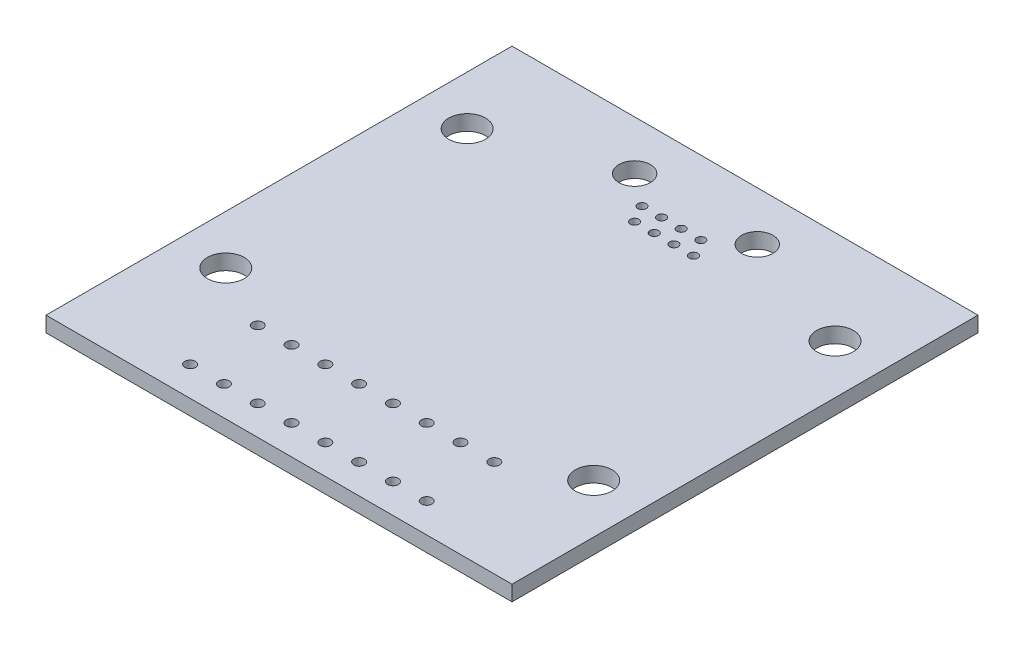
ISO-10303-21;
HEADER;
FILE_DESCRIPTION(('STEP AP214'),'2;1');
FILE_NAME('part.step','',(''),(''),'','','');
FILE_SCHEMA(('AUTOMOTIVE_DESIGN { 1 0 10303 214 1 1 1 1 }'));
ENDSEC;
DATA;
#1=APPLICATION_CONTEXT('core data for automotive mechanical design processes');
#2=APPLICATION_PROTOCOL_DEFINITION('international standard','automotive_design',2000,#1);
#3=PRODUCT_CONTEXT('',#1,'mechanical');
#4=PRODUCT('Part','Part','',(#3));
#5=PRODUCT_RELATED_PRODUCT_CATEGORY('part','',(#4));
#6=PRODUCT_DEFINITION_FORMATION('','',#4);
#7=PRODUCT_DEFINITION_CONTEXT('part definition',#1,'design');
#8=PRODUCT_DEFINITION('design','',#6,#7);
#9=PRODUCT_DEFINITION_SHAPE('','',#8);
#10=(LENGTH_UNIT() NAMED_UNIT(*) SI_UNIT(.MILLI.,.METRE.));
#11=(NAMED_UNIT(*) PLANE_ANGLE_UNIT() SI_UNIT($,.RADIAN.));
#12=(NAMED_UNIT(*) SI_UNIT($,.STERADIAN.) SOLID_ANGLE_UNIT());
#13=UNCERTAINTY_MEASURE_WITH_UNIT(LENGTH_MEASURE(1.E-05),#10,'distance_accuracy_value','');
#14=(GEOMETRIC_REPRESENTATION_CONTEXT(3) GLOBAL_UNCERTAINTY_ASSIGNED_CONTEXT((#13)) GLOBAL_UNIT_ASSIGNED_CONTEXT((#10,
#11,#12)) REPRESENTATION_CONTEXT('',''));
#15=CARTESIAN_POINT('',(0.,0.,0.));
#16=DIRECTION('',(0.,0.,1.));
#17=DIRECTION('',(1.,0.,0.));
#18=AXIS2_PLACEMENT_3D('',#15,#16,#17);
#19=CARTESIAN_POINT('',(0.,1.5875,0.));
#20=DIRECTION('',(0.,1.,0.));
#21=DIRECTION('',(0.,0.,1.));
#22=AXIS2_PLACEMENT_3D('',#19,#20,#21);
#23=PLANE('',#22);
#24=CARTESIAN_POINT('',(8.75,1.5875,-3.048));
#25=DIRECTION('',(0.,1.,0.));
#26=DIRECTION('',(0.,0.,-1.));
#27=AXIS2_PLACEMENT_3D('',#24,#25,#26);
#28=CIRCLE('',#27,0.55);
#29=CARTESIAN_POINT('',(8.75,1.5875,-3.598));
#30=VERTEX_POINT('',#29);
#31=EDGE_CURVE('E277',#30,#30,#28,.T.);
#32=ORIENTED_EDGE('',*,*,#31,.F.);
#33=EDGE_LOOP('',(#32));
#34=FACE_BOUND('',#33,.T.);
#35=CARTESIAN_POINT('',(1.75,1.5875,-3.048));
#36=DIRECTION('',(0.,1.,0.));
#37=DIRECTION('',(0.,0.,-1.));
#38=AXIS2_PLACEMENT_3D('',#35,#36,#37);
#39=CIRCLE('',#38,0.55);
#40=CARTESIAN_POINT('',(1.75,1.5875,-3.598));
#41=VERTEX_POINT('',#40);
#42=EDGE_CURVE('E265',#41,#41,#39,.T.);
#43=ORIENTED_EDGE('',*,*,#42,.F.);
#44=EDGE_LOOP('',(#43));
#45=FACE_BOUND('',#44,.T.);
#46=CARTESIAN_POINT('',(5.25,1.5875,-10.04824));
#47=DIRECTION('',(0.,1.,0.));
#48=DIRECTION('',(0.,0.,-1.));
#49=AXIS2_PLACEMENT_3D('',#46,#47,#48);
#50=CIRCLE('',#49,0.550000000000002);
#51=CARTESIAN_POINT('',(5.25,1.5875,-10.59824));
#52=VERTEX_POINT('',#51);
#53=EDGE_CURVE('E253',#52,#52,#50,.T.);
#54=ORIENTED_EDGE('',*,*,#53,.F.);
#55=EDGE_LOOP('',(#54));
#56=FACE_BOUND('',#55,.T.);
#57=CARTESIAN_POINT('',(12.25,1.5875,-10.04824));
#58=DIRECTION('',(0.,1.,0.));
#59=DIRECTION('',(0.,0.,-1.));
#60=AXIS2_PLACEMENT_3D('',#57,#58,#59);
#61=CIRCLE('',#60,0.549999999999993);
#62=CARTESIAN_POINT('',(12.25,1.5875,-10.59824));
#63=VERTEX_POINT('',#62);
#64=EDGE_CURVE('E241',#63,#63,#61,.T.);
#65=ORIENTED_EDGE('',*,*,#64,.F.);
#66=EDGE_LOOP('',(#65));
#67=FACE_BOUND('',#66,.T.);
#68=CARTESIAN_POINT('',(19.05,1.5875,-38.53434));
#69=DIRECTION('',(0.,1.,0.));
#70=DIRECTION('',(0.,0.,-1.));
#71=AXIS2_PLACEMENT_3D('',#68,#69,#70);
#72=CIRCLE('',#71,1.905);
#73=CARTESIAN_POINT('',(19.05,1.5875,-40.43934));
#74=VERTEX_POINT('',#73);
#75=EDGE_CURVE('E229',#74,#74,#72,.T.);
#76=ORIENTED_EDGE('',*,*,#75,.F.);
#77=EDGE_LOOP('',(#76));
#78=FACE_BOUND('',#77,.T.);
#79=CARTESIAN_POINT('',(4.064,1.5875,-38.862));
#80=DIRECTION('',(0.,1.,0.));
#81=DIRECTION('',(0.,0.,1.));
#82=AXIS2_PLACEMENT_3D('',#79,#80,#81);
#83=CIRCLE('',#82,0.4445);
#84=CARTESIAN_POINT('',(4.064,1.5875,-38.4175));
#85=VERTEX_POINT('',#84);
#86=EDGE_CURVE('E217',#85,#85,#83,.T.);
#87=ORIENTED_EDGE('',*,*,#86,.F.);
#88=EDGE_LOOP('',(#87));
#89=FACE_BOUND('',#88,.T.);
#90=CARTESIAN_POINT('',(0.,1.5875,-38.862));
#91=DIRECTION('',(0.,1.,0.));
#92=DIRECTION('',(0.,0.,1.));
#93=AXIS2_PLACEMENT_3D('',#90,#91,#92);
#94=CIRCLE('',#93,0.444499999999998);
#95=CARTESIAN_POINT('',(0.,1.5875,-38.4175));
#96=VERTEX_POINT('',#95);
#97=EDGE_CURVE('E205',#96,#96,#94,.T.);
#98=ORIENTED_EDGE('',*,*,#97,.F.);
#99=EDGE_LOOP('',(#98));
#100=FACE_BOUND('',#99,.T.);
#101=CARTESIAN_POINT('',(3.048,1.5875,-40.64));
#102=DIRECTION('',(0.,1.,0.));
#103=DIRECTION('',(0.,0.,1.));
#104=AXIS2_PLACEMENT_3D('',#101,#102,#103);
#105=CIRCLE('',#104,0.444499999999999);
#106=CARTESIAN_POINT('',(3.048,1.5875,-40.1955));
#107=VERTEX_POINT('',#106);
#108=EDGE_CURVE('E193',#107,#107,#105,.T.);
#109=ORIENTED_EDGE('',*,*,#108,.F.);
#110=EDGE_LOOP('',(#109));
#111=FACE_BOUND('',#110,.T.);
#112=CARTESIAN_POINT('',(-1.016,1.5875,-40.64));
#113=DIRECTION('',(0.,1.,0.));
#114=DIRECTION('',(0.,0.,1.));
#115=AXIS2_PLACEMENT_3D('',#112,#113,#114);
#116=CIRCLE('',#115,0.444499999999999);
#117=CARTESIAN_POINT('',(-1.016,1.5875,-40.1955));
#118=VERTEX_POINT('',#117);
#119=EDGE_CURVE('E181',#118,#118,#116,.T.);
#120=ORIENTED_EDGE('',*,*,#119,.F.);
#121=EDGE_LOOP('',(#120));
#122=FACE_BOUND('',#121,.T.);
#123=CARTESIAN_POINT('',(-1.75,1.5875,-3.048));
#124=DIRECTION('',(0.,1.,0.));
#125=DIRECTION('',(0.,0.,1.));
#126=AXIS2_PLACEMENT_3D('',#123,#124,#125);
#127=CIRCLE('',#126,0.55);
#128=CARTESIAN_POINT('',(-1.75,1.5875,-2.498));
#129=VERTEX_POINT('',#128);
#130=EDGE_CURVE('E169',#129,#129,#127,.T.);
#131=ORIENTED_EDGE('',*,*,#130,.F.);
#132=EDGE_LOOP('',(#131));
#133=FACE_BOUND('',#132,.T.);
#134=CARTESIAN_POINT('',(-5.25,1.5875,-10.04824));
#135=DIRECTION('',(0.,1.,0.));
#136=DIRECTION('',(0.,0.,1.));
#137=AXIS2_PLACEMENT_3D('',#134,#135,#136);
#138=CIRCLE('',#137,0.55);
#139=CARTESIAN_POINT('',(-5.25,1.5875,-9.49824));
#140=VERTEX_POINT('',#139);
#141=EDGE_CURVE('E157',#140,#140,#138,.T.);
#142=ORIENTED_EDGE('',*,*,#141,.F.);
#143=EDGE_LOOP('',(#142));
#144=FACE_BOUND('',#143,.T.);
#145=CARTESIAN_POINT('',(-8.75,1.5875,-10.04824));
#146=DIRECTION('',(0.,1.,0.));
#147=DIRECTION('',(0.,0.,1.));
#148=AXIS2_PLACEMENT_3D('',#145,#146,#147);
#149=CIRCLE('',#148,0.55);
#150=CARTESIAN_POINT('',(-8.75,1.5875,-9.49824));
#151=VERTEX_POINT('',#150);
#152=EDGE_CURVE('E145',#151,#151,#149,.T.);
#153=ORIENTED_EDGE('',*,*,#152,.F.);
#154=EDGE_LOOP('',(#153));
#155=FACE_BOUND('',#154,.T.);
#156=CARTESIAN_POINT('',(-12.25,1.5875,-3.048));
#157=DIRECTION('',(0.,1.,0.));
#158=DIRECTION('',(0.,0.,1.));
#159=AXIS2_PLACEMENT_3D('',#156,#157,#158);
#160=CIRCLE('',#159,0.549999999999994);
#161=CARTESIAN_POINT('',(-12.25,1.5875,-2.49800000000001));
#162=VERTEX_POINT('',#161);
#163=EDGE_CURVE('E133',#162,#162,#160,.T.);
#164=ORIENTED_EDGE('',*,*,#163,.F.);
#165=EDGE_LOOP('',(#164));
#166=FACE_BOUND('',#165,.T.);
#167=CARTESIAN_POINT('',(-19.05,1.5875,-13.5382));
#168=DIRECTION('',(0.,1.,0.));
#169=DIRECTION('',(0.,0.,1.));
#170=AXIS2_PLACEMENT_3D('',#167,#168,#169);
#171=CIRCLE('',#170,1.905);
#172=CARTESIAN_POINT('',(-19.05,1.5875,-11.6332));
#173=VERTEX_POINT('',#172);
#174=EDGE_CURVE('E121',#173,#173,#171,.T.);
#175=ORIENTED_EDGE('',*,*,#174,.F.);
#176=EDGE_LOOP('',(#175));
#177=FACE_BOUND('',#176,.T.);
#178=CARTESIAN_POINT('',(-6.35,1.5875,-43.18));
#179=DIRECTION('',(0.,1.,0.));
#180=DIRECTION('',(0.,0.,1.));
#181=AXIS2_PLACEMENT_3D('',#178,#179,#180);
#182=CIRCLE('',#181,1.6256);
#183=CARTESIAN_POINT('',(-6.35,1.5875,-41.5544));
#184=VERTEX_POINT('',#183);
#185=EDGE_CURVE('E100',#184,#184,#182,.T.);
#186=ORIENTED_EDGE('',*,*,#185,.F.);
#187=EDGE_LOOP('',(#186));
#188=FACE_BOUND('',#187,.T.);
#189=DIRECTION('',(0.,0.,1.));
#190=VECTOR('',#189,1.);
#191=CARTESIAN_POINT('',(-24.13,1.5875,-48.26));
#192=LINE('',#191,#190);
#193=CARTESIAN_POINT('',(-24.13,1.5875,-48.26));
#194=VERTEX_POINT('',#193);
#195=CARTESIAN_POINT('',(-24.13,1.5875,0.));
#196=VERTEX_POINT('',#195);
#197=EDGE_CURVE('E85',#194,#196,#192,.T.);
#198=ORIENTED_EDGE('',*,*,#197,.T.);
#199=DIRECTION('',(1.,0.,0.));
#200=VECTOR('',#199,1.);
#201=CARTESIAN_POINT('',(-24.13,1.5875,0.));
#202=LINE('',#201,#200);
#203=CARTESIAN_POINT('',(24.13,1.5875,0.));
#204=VERTEX_POINT('',#203);
#205=EDGE_CURVE('E80',#196,#204,#202,.T.);
#206=ORIENTED_EDGE('',*,*,#205,.T.);
#207=DIRECTION('',(0.,0.,-1.));
#208=VECTOR('',#207,1.);
#209=CARTESIAN_POINT('',(24.13,1.5875,-48.26));
#210=LINE('',#209,#208);
#211=CARTESIAN_POINT('',(24.13,1.5875,-48.26));
#212=VERTEX_POINT('',#211);
#213=EDGE_CURVE('E83',#204,#212,#210,.T.);
#214=ORIENTED_EDGE('',*,*,#213,.T.);
#215=DIRECTION('',(-1.,0.,0.));
#216=VECTOR('',#215,1.);
#217=CARTESIAN_POINT('',(-24.13,1.5875,-48.26));
#218=LINE('',#217,#216);
#219=EDGE_CURVE('E50',#212,#194,#218,.T.);
#220=ORIENTED_EDGE('',*,*,#219,.T.);
#221=EDGE_LOOP('',(#198,#206,#214,#220));
#222=FACE_BOUND('',#221,.T.);
#223=CARTESIAN_POINT('',(-19.05,1.5875,-38.53434));
#224=DIRECTION('',(0.,1.,0.));
#225=DIRECTION('',(0.,0.,1.));
#226=AXIS2_PLACEMENT_3D('',#223,#224,#225);
#227=CIRCLE('',#226,1.905);
#228=CARTESIAN_POINT('',(-19.05,1.5875,-36.62934));
#229=VERTEX_POINT('',#228);
#230=EDGE_CURVE('E115',#229,#229,#227,.T.);
#231=ORIENTED_EDGE('',*,*,#230,.F.);
#232=EDGE_LOOP('',(#231));
#233=FACE_BOUND('',#232,.T.);
#234=CARTESIAN_POINT('',(-12.25,1.5875,-10.04824));
#235=DIRECTION('',(0.,1.,0.));
#236=DIRECTION('',(0.,0.,1.));
#237=AXIS2_PLACEMENT_3D('',#234,#235,#236);
#238=CIRCLE('',#237,0.549999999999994);
#239=CARTESIAN_POINT('',(-12.25,1.5875,-9.49824));
#240=VERTEX_POINT('',#239);
#241=EDGE_CURVE('E127',#240,#240,#238,.T.);
#242=ORIENTED_EDGE('',*,*,#241,.F.);
#243=EDGE_LOOP('',(#242));
#244=FACE_BOUND('',#243,.T.);
#245=CARTESIAN_POINT('',(-8.75,1.5875,-3.048));
#246=DIRECTION('',(0.,1.,0.));
#247=DIRECTION('',(0.,0.,1.));
#248=AXIS2_PLACEMENT_3D('',#245,#246,#247);
#249=CIRCLE('',#248,0.55);
#250=CARTESIAN_POINT('',(-8.75,1.5875,-2.498));
#251=VERTEX_POINT('',#250);
#252=EDGE_CURVE('E139',#251,#251,#249,.T.);
#253=ORIENTED_EDGE('',*,*,#252,.F.);
#254=EDGE_LOOP('',(#253));
#255=FACE_BOUND('',#254,.T.);
#256=CARTESIAN_POINT('',(-5.25,1.5875,-3.048));
#257=DIRECTION('',(0.,1.,0.));
#258=DIRECTION('',(0.,0.,1.));
#259=AXIS2_PLACEMENT_3D('',#256,#257,#258);
#260=CIRCLE('',#259,0.55);
#261=CARTESIAN_POINT('',(-5.25,1.5875,-2.498));
#262=VERTEX_POINT('',#261);
#263=EDGE_CURVE('E151',#262,#262,#260,.T.);
#264=ORIENTED_EDGE('',*,*,#263,.F.);
#265=EDGE_LOOP('',(#264));
#266=FACE_BOUND('',#265,.T.);
#267=CARTESIAN_POINT('',(-1.75,1.5875,-10.04824));
#268=DIRECTION('',(0.,1.,0.));
#269=DIRECTION('',(0.,0.,1.));
#270=AXIS2_PLACEMENT_3D('',#267,#268,#269);
#271=CIRCLE('',#270,0.55);
#272=CARTESIAN_POINT('',(-1.75,1.5875,-9.49824));
#273=VERTEX_POINT('',#272);
#274=EDGE_CURVE('E163',#273,#273,#271,.T.);
#275=ORIENTED_EDGE('',*,*,#274,.F.);
#276=EDGE_LOOP('',(#275));
#277=FACE_BOUND('',#276,.T.);
#278=CARTESIAN_POINT('',(-3.048,1.5875,-40.64));
#279=DIRECTION('',(0.,1.,0.));
#280=DIRECTION('',(0.,0.,1.));
#281=AXIS2_PLACEMENT_3D('',#278,#279,#280);
#282=CIRCLE('',#281,0.444499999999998);
#283=CARTESIAN_POINT('',(-3.048,1.5875,-40.1955));
#284=VERTEX_POINT('',#283);
#285=EDGE_CURVE('E175',#284,#284,#282,.T.);
#286=ORIENTED_EDGE('',*,*,#285,.F.);
#287=EDGE_LOOP('',(#286));
#288=FACE_BOUND('',#287,.T.);
#289=CARTESIAN_POINT('',(1.016,1.5875,-40.64));
#290=DIRECTION('',(0.,1.,0.));
#291=DIRECTION('',(0.,0.,1.));
#292=AXIS2_PLACEMENT_3D('',#289,#290,#291);
#293=CIRCLE('',#292,0.444499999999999);
#294=CARTESIAN_POINT('',(1.016,1.5875,-40.1955));
#295=VERTEX_POINT('',#294);
#296=EDGE_CURVE('E187',#295,#295,#293,.T.);
#297=ORIENTED_EDGE('',*,*,#296,.F.);
#298=EDGE_LOOP('',(#297));
#299=FACE_BOUND('',#298,.T.);
#300=CARTESIAN_POINT('',(-2.032,1.5875,-38.862));
#301=DIRECTION('',(0.,1.,0.));
#302=DIRECTION('',(0.,0.,1.));
#303=AXIS2_PLACEMENT_3D('',#300,#301,#302);
#304=CIRCLE('',#303,0.444499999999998);
#305=CARTESIAN_POINT('',(-2.032,1.5875,-38.4175));
#306=VERTEX_POINT('',#305);
#307=EDGE_CURVE('E199',#306,#306,#304,.T.);
#308=ORIENTED_EDGE('',*,*,#307,.F.);
#309=EDGE_LOOP('',(#308));
#310=FACE_BOUND('',#309,.T.);
#311=CARTESIAN_POINT('',(2.032,1.5875,-38.862));
#312=DIRECTION('',(0.,1.,0.));
#313=DIRECTION('',(0.,0.,1.));
#314=AXIS2_PLACEMENT_3D('',#311,#312,#313);
#315=CIRCLE('',#314,0.444499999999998);
#316=CARTESIAN_POINT('',(2.032,1.5875,-38.4175));
#317=VERTEX_POINT('',#316);
#318=EDGE_CURVE('E211',#317,#317,#315,.T.);
#319=ORIENTED_EDGE('',*,*,#318,.F.);
#320=EDGE_LOOP('',(#319));
#321=FACE_BOUND('',#320,.T.);
#322=CARTESIAN_POINT('',(6.34999999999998,1.5875,-43.18));
#323=DIRECTION('',(0.,1.,0.));
#324=DIRECTION('',(0.,0.,-1.));
#325=AXIS2_PLACEMENT_3D('',#322,#323,#324);
#326=CIRCLE('',#325,1.6256);
#327=CARTESIAN_POINT('',(6.34999999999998,1.5875,-44.8056));
#328=VERTEX_POINT('',#327);
#329=EDGE_CURVE('E223',#328,#328,#326,.T.);
#330=ORIENTED_EDGE('',*,*,#329,.F.);
#331=EDGE_LOOP('',(#330));
#332=FACE_BOUND('',#331,.T.);
#333=CARTESIAN_POINT('',(19.05,1.5875,-13.5382));
#334=DIRECTION('',(0.,1.,0.));
#335=DIRECTION('',(0.,0.,-1.));
#336=AXIS2_PLACEMENT_3D('',#333,#334,#335);
#337=CIRCLE('',#336,1.905);
#338=CARTESIAN_POINT('',(19.05,1.5875,-15.4432));
#339=VERTEX_POINT('',#338);
#340=EDGE_CURVE('E235',#339,#339,#337,.T.);
#341=ORIENTED_EDGE('',*,*,#340,.F.);
#342=EDGE_LOOP('',(#341));
#343=FACE_BOUND('',#342,.T.);
#344=CARTESIAN_POINT('',(8.75,1.5875,-10.04824));
#345=DIRECTION('',(0.,1.,0.));
#346=DIRECTION('',(0.,0.,-1.));
#347=AXIS2_PLACEMENT_3D('',#344,#345,#346);
#348=CIRCLE('',#347,0.55);
#349=CARTESIAN_POINT('',(8.75,1.5875,-10.59824));
#350=VERTEX_POINT('',#349);
#351=EDGE_CURVE('E247',#350,#350,#348,.T.);
#352=ORIENTED_EDGE('',*,*,#351,.F.);
#353=EDGE_LOOP('',(#352));
#354=FACE_BOUND('',#353,.T.);
#355=CARTESIAN_POINT('',(1.75,1.5875,-10.04824));
#356=DIRECTION('',(0.,1.,0.));
#357=DIRECTION('',(0.,0.,-1.));
#358=AXIS2_PLACEMENT_3D('',#355,#356,#357);
#359=CIRCLE('',#358,0.55);
#360=CARTESIAN_POINT('',(1.75,1.5875,-10.59824));
#361=VERTEX_POINT('',#360);
#362=EDGE_CURVE('E259',#361,#361,#359,.T.);
#363=ORIENTED_EDGE('',*,*,#362,.F.);
#364=EDGE_LOOP('',(#363));
#365=FACE_BOUND('',#364,.T.);
#366=CARTESIAN_POINT('',(5.25,1.5875,-3.048));
#367=DIRECTION('',(0.,1.,0.));
#368=DIRECTION('',(0.,0.,-1.));
#369=AXIS2_PLACEMENT_3D('',#366,#367,#368);
#370=CIRCLE('',#369,0.55);
#371=CARTESIAN_POINT('',(5.25,1.5875,-3.598));
#372=VERTEX_POINT('',#371);
#373=EDGE_CURVE('E271',#372,#372,#370,.T.);
#374=ORIENTED_EDGE('',*,*,#373,.F.);
#375=EDGE_LOOP('',(#374));
#376=FACE_BOUND('',#375,.T.);
#377=CARTESIAN_POINT('',(12.25,1.5875,-3.048));
#378=DIRECTION('',(0.,1.,0.));
#379=DIRECTION('',(0.,0.,-1.));
#380=AXIS2_PLACEMENT_3D('',#377,#378,#379);
#381=CIRCLE('',#380,0.549999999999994);
#382=CARTESIAN_POINT('',(12.25,1.5875,-3.598));
#383=VERTEX_POINT('',#382);
#384=EDGE_CURVE('E283',#383,#383,#381,.T.);
#385=ORIENTED_EDGE('',*,*,#384,.F.);
#386=EDGE_LOOP('',(#385));
#387=FACE_BOUND('',#386,.T.);
#388=ADVANCED_FACE('F33',(#34,#45,#56,#67,#78,#89,#100,#111,#122,#133,#144,#155,#166,#177,#188,
#222,#233,#244,#255,#266,#277,#288,#299,#310,#321,#332,#343,#354,#365,#376,#387),#23,.T.);
#389=CARTESIAN_POINT('',(0.,0.,0.));
#390=DIRECTION('',(0.,1.,0.));
#391=DIRECTION('',(0.,0.,1.));
#392=AXIS2_PLACEMENT_3D('',#389,#390,#391);
#393=PLANE('',#392);
#394=CARTESIAN_POINT('',(8.75,0.,-3.048));
#395=DIRECTION('',(0.,1.,0.));
#396=DIRECTION('',(0.,0.,-1.));
#397=AXIS2_PLACEMENT_3D('',#394,#395,#396);
#398=CIRCLE('',#397,0.55);
#399=CARTESIAN_POINT('',(8.75,0.,-3.598));
#400=VERTEX_POINT('',#399);
#401=EDGE_CURVE('E280',#400,#400,#398,.T.);
#402=ORIENTED_EDGE('',*,*,#401,.T.);
#403=EDGE_LOOP('',(#402));
#404=FACE_BOUND('',#403,.T.);
#405=CARTESIAN_POINT('',(1.75,0.,-3.048));
#406=DIRECTION('',(0.,1.,0.));
#407=DIRECTION('',(0.,0.,-1.));
#408=AXIS2_PLACEMENT_3D('',#405,#406,#407);
#409=CIRCLE('',#408,0.55);
#410=CARTESIAN_POINT('',(1.75,0.,-3.598));
#411=VERTEX_POINT('',#410);
#412=EDGE_CURVE('E268',#411,#411,#409,.T.);
#413=ORIENTED_EDGE('',*,*,#412,.T.);
#414=EDGE_LOOP('',(#413));
#415=FACE_BOUND('',#414,.T.);
#416=CARTESIAN_POINT('',(5.25,0.,-10.04824));
#417=DIRECTION('',(0.,1.,0.));
#418=DIRECTION('',(0.,0.,-1.));
#419=AXIS2_PLACEMENT_3D('',#416,#417,#418);
#420=CIRCLE('',#419,0.550000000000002);
#421=CARTESIAN_POINT('',(5.25,0.,-10.59824));
#422=VERTEX_POINT('',#421);
#423=EDGE_CURVE('E256',#422,#422,#420,.T.);
#424=ORIENTED_EDGE('',*,*,#423,.T.);
#425=EDGE_LOOP('',(#424));
#426=FACE_BOUND('',#425,.T.);
#427=CARTESIAN_POINT('',(12.25,0.,-10.04824));
#428=DIRECTION('',(0.,1.,0.));
#429=DIRECTION('',(0.,0.,-1.));
#430=AXIS2_PLACEMENT_3D('',#427,#428,#429);
#431=CIRCLE('',#430,0.549999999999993);
#432=CARTESIAN_POINT('',(12.25,0.,-10.59824));
#433=VERTEX_POINT('',#432);
#434=EDGE_CURVE('E244',#433,#433,#431,.T.);
#435=ORIENTED_EDGE('',*,*,#434,.T.);
#436=EDGE_LOOP('',(#435));
#437=FACE_BOUND('',#436,.T.);
#438=CARTESIAN_POINT('',(19.05,0.,-38.53434));
#439=DIRECTION('',(0.,1.,0.));
#440=DIRECTION('',(0.,0.,-1.));
#441=AXIS2_PLACEMENT_3D('',#438,#439,#440);
#442=CIRCLE('',#441,1.905);
#443=CARTESIAN_POINT('',(19.05,0.,-40.43934));
#444=VERTEX_POINT('',#443);
#445=EDGE_CURVE('E232',#444,#444,#442,.T.);
#446=ORIENTED_EDGE('',*,*,#445,.T.);
#447=EDGE_LOOP('',(#446));
#448=FACE_BOUND('',#447,.T.);
#449=CARTESIAN_POINT('',(4.064,0.,-38.862));
#450=DIRECTION('',(0.,1.,0.));
#451=DIRECTION('',(0.,0.,1.));
#452=AXIS2_PLACEMENT_3D('',#449,#450,#451);
#453=CIRCLE('',#452,0.4445);
#454=CARTESIAN_POINT('',(4.064,0.,-38.4175));
#455=VERTEX_POINT('',#454);
#456=EDGE_CURVE('E220',#455,#455,#453,.T.);
#457=ORIENTED_EDGE('',*,*,#456,.T.);
#458=EDGE_LOOP('',(#457));
#459=FACE_BOUND('',#458,.T.);
#460=CARTESIAN_POINT('',(0.,0.,-38.862));
#461=DIRECTION('',(0.,1.,0.));
#462=DIRECTION('',(0.,0.,1.));
#463=AXIS2_PLACEMENT_3D('',#460,#461,#462);
#464=CIRCLE('',#463,0.444499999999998);
#465=CARTESIAN_POINT('',(0.,0.,-38.4175));
#466=VERTEX_POINT('',#465);
#467=EDGE_CURVE('E208',#466,#466,#464,.T.);
#468=ORIENTED_EDGE('',*,*,#467,.T.);
#469=EDGE_LOOP('',(#468));
#470=FACE_BOUND('',#469,.T.);
#471=CARTESIAN_POINT('',(3.048,0.,-40.64));
#472=DIRECTION('',(0.,1.,0.));
#473=DIRECTION('',(0.,0.,1.));
#474=AXIS2_PLACEMENT_3D('',#471,#472,#473);
#475=CIRCLE('',#474,0.444499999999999);
#476=CARTESIAN_POINT('',(3.048,0.,-40.1955));
#477=VERTEX_POINT('',#476);
#478=EDGE_CURVE('E196',#477,#477,#475,.T.);
#479=ORIENTED_EDGE('',*,*,#478,.T.);
#480=EDGE_LOOP('',(#479));
#481=FACE_BOUND('',#480,.T.);
#482=CARTESIAN_POINT('',(-1.016,0.,-40.64));
#483=DIRECTION('',(0.,1.,0.));
#484=DIRECTION('',(0.,0.,1.));
#485=AXIS2_PLACEMENT_3D('',#482,#483,#484);
#486=CIRCLE('',#485,0.444499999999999);
#487=CARTESIAN_POINT('',(-1.016,0.,-40.1955));
#488=VERTEX_POINT('',#487);
#489=EDGE_CURVE('E184',#488,#488,#486,.T.);
#490=ORIENTED_EDGE('',*,*,#489,.T.);
#491=EDGE_LOOP('',(#490));
#492=FACE_BOUND('',#491,.T.);
#493=CARTESIAN_POINT('',(-1.75,0.,-3.048));
#494=DIRECTION('',(0.,1.,0.));
#495=DIRECTION('',(0.,0.,1.));
#496=AXIS2_PLACEMENT_3D('',#493,#494,#495);
#497=CIRCLE('',#496,0.55);
#498=CARTESIAN_POINT('',(-1.75,0.,-2.498));
#499=VERTEX_POINT('',#498);
#500=EDGE_CURVE('E172',#499,#499,#497,.T.);
#501=ORIENTED_EDGE('',*,*,#500,.T.);
#502=EDGE_LOOP('',(#501));
#503=FACE_BOUND('',#502,.T.);
#504=CARTESIAN_POINT('',(-5.25,0.,-10.04824));
#505=DIRECTION('',(0.,1.,0.));
#506=DIRECTION('',(0.,0.,1.));
#507=AXIS2_PLACEMENT_3D('',#504,#505,#506);
#508=CIRCLE('',#507,0.55);
#509=CARTESIAN_POINT('',(-5.25,0.,-9.49824));
#510=VERTEX_POINT('',#509);
#511=EDGE_CURVE('E160',#510,#510,#508,.T.);
#512=ORIENTED_EDGE('',*,*,#511,.T.);
#513=EDGE_LOOP('',(#512));
#514=FACE_BOUND('',#513,.T.);
#515=CARTESIAN_POINT('',(-8.75,0.,-10.04824));
#516=DIRECTION('',(0.,1.,0.));
#517=DIRECTION('',(0.,0.,1.));
#518=AXIS2_PLACEMENT_3D('',#515,#516,#517);
#519=CIRCLE('',#518,0.55);
#520=CARTESIAN_POINT('',(-8.75,0.,-9.49824));
#521=VERTEX_POINT('',#520);
#522=EDGE_CURVE('E148',#521,#521,#519,.T.);
#523=ORIENTED_EDGE('',*,*,#522,.T.);
#524=EDGE_LOOP('',(#523));
#525=FACE_BOUND('',#524,.T.);
#526=CARTESIAN_POINT('',(-12.25,0.,-3.048));
#527=DIRECTION('',(0.,1.,0.));
#528=DIRECTION('',(0.,0.,1.));
#529=AXIS2_PLACEMENT_3D('',#526,#527,#528);
#530=CIRCLE('',#529,0.549999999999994);
#531=CARTESIAN_POINT('',(-12.25,0.,-2.49800000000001));
#532=VERTEX_POINT('',#531);
#533=EDGE_CURVE('E136',#532,#532,#530,.T.);
#534=ORIENTED_EDGE('',*,*,#533,.T.);
#535=EDGE_LOOP('',(#534));
#536=FACE_BOUND('',#535,.T.);
#537=CARTESIAN_POINT('',(-19.05,0.,-13.5382));
#538=DIRECTION('',(0.,1.,0.));
#539=DIRECTION('',(0.,0.,1.));
#540=AXIS2_PLACEMENT_3D('',#537,#538,#539);
#541=CIRCLE('',#540,1.905);
#542=CARTESIAN_POINT('',(-19.05,0.,-11.6332));
#543=VERTEX_POINT('',#542);
#544=EDGE_CURVE('E124',#543,#543,#541,.T.);
#545=ORIENTED_EDGE('',*,*,#544,.T.);
#546=EDGE_LOOP('',(#545));
#547=FACE_BOUND('',#546,.T.);
#548=CARTESIAN_POINT('',(-6.35,0.,-43.18));
#549=DIRECTION('',(0.,1.,0.));
#550=DIRECTION('',(0.,0.,1.));
#551=AXIS2_PLACEMENT_3D('',#548,#549,#550);
#552=CIRCLE('',#551,1.6256);
#553=CARTESIAN_POINT('',(-6.35,0.,-41.5544));
#554=VERTEX_POINT('',#553);
#555=EDGE_CURVE('E112',#554,#554,#552,.T.);
#556=ORIENTED_EDGE('',*,*,#555,.T.);
#557=EDGE_LOOP('',(#556));
#558=FACE_BOUND('',#557,.T.);
#559=DIRECTION('',(0.,0.,1.));
#560=VECTOR('',#559,1.);
#561=CARTESIAN_POINT('',(-24.13,0.,-48.26));
#562=LINE('',#561,#560);
#563=CARTESIAN_POINT('',(-24.13,0.,-48.26));
#564=VERTEX_POINT('',#563);
#565=CARTESIAN_POINT('',(-24.13,0.,0.));
#566=VERTEX_POINT('',#565);
#567=EDGE_CURVE('E97',#564,#566,#562,.T.);
#568=ORIENTED_EDGE('',*,*,#567,.F.);
#569=DIRECTION('',(-1.,0.,0.));
#570=VECTOR('',#569,1.);
#571=CARTESIAN_POINT('',(-24.13,0.,-48.26));
#572=LINE('',#571,#570);
#573=CARTESIAN_POINT('',(24.13,0.,-48.26));
#574=VERTEX_POINT('',#573);
#575=EDGE_CURVE('E73',#574,#564,#572,.T.);
#576=ORIENTED_EDGE('',*,*,#575,.F.);
#577=DIRECTION('',(0.,0.,-1.));
#578=VECTOR('',#577,1.);
#579=CARTESIAN_POINT('',(24.13,0.,-48.26));
#580=LINE('',#579,#578);
#581=CARTESIAN_POINT('',(24.13,0.,0.));
#582=VERTEX_POINT('',#581);
#583=EDGE_CURVE('E67',#582,#574,#580,.T.);
#584=ORIENTED_EDGE('',*,*,#583,.F.);
#585=DIRECTION('',(1.,0.,0.));
#586=VECTOR('',#585,1.);
#587=CARTESIAN_POINT('',(-24.13,0.,0.));
#588=LINE('',#587,#586);
#589=EDGE_CURVE('E89',#566,#582,#588,.T.);
#590=ORIENTED_EDGE('',*,*,#589,.F.);
#591=EDGE_LOOP('',(#568,#576,#584,#590));
#592=FACE_BOUND('',#591,.T.);
#593=CARTESIAN_POINT('',(-19.05,0.,-38.53434));
#594=DIRECTION('',(0.,1.,0.));
#595=DIRECTION('',(0.,0.,1.));
#596=AXIS2_PLACEMENT_3D('',#593,#594,#595);
#597=CIRCLE('',#596,1.905);
#598=CARTESIAN_POINT('',(-19.05,0.,-36.62934));
#599=VERTEX_POINT('',#598);
#600=EDGE_CURVE('E118',#599,#599,#597,.T.);
#601=ORIENTED_EDGE('',*,*,#600,.T.);
#602=EDGE_LOOP('',(#601));
#603=FACE_BOUND('',#602,.T.);
#604=CARTESIAN_POINT('',(-12.25,0.,-10.04824));
#605=DIRECTION('',(0.,1.,0.));
#606=DIRECTION('',(0.,0.,1.));
#607=AXIS2_PLACEMENT_3D('',#604,#605,#606);
#608=CIRCLE('',#607,0.549999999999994);
#609=CARTESIAN_POINT('',(-12.25,0.,-9.49824));
#610=VERTEX_POINT('',#609);
#611=EDGE_CURVE('E130',#610,#610,#608,.T.);
#612=ORIENTED_EDGE('',*,*,#611,.T.);
#613=EDGE_LOOP('',(#612));
#614=FACE_BOUND('',#613,.T.);
#615=CARTESIAN_POINT('',(-8.75,0.,-3.048));
#616=DIRECTION('',(0.,1.,0.));
#617=DIRECTION('',(0.,0.,1.));
#618=AXIS2_PLACEMENT_3D('',#615,#616,#617);
#619=CIRCLE('',#618,0.55);
#620=CARTESIAN_POINT('',(-8.75,0.,-2.498));
#621=VERTEX_POINT('',#620);
#622=EDGE_CURVE('E142',#621,#621,#619,.T.);
#623=ORIENTED_EDGE('',*,*,#622,.T.);
#624=EDGE_LOOP('',(#623));
#625=FACE_BOUND('',#624,.T.);
#626=CARTESIAN_POINT('',(-5.25,0.,-3.048));
#627=DIRECTION('',(0.,1.,0.));
#628=DIRECTION('',(0.,0.,1.));
#629=AXIS2_PLACEMENT_3D('',#626,#627,#628);
#630=CIRCLE('',#629,0.55);
#631=CARTESIAN_POINT('',(-5.25,0.,-2.498));
#632=VERTEX_POINT('',#631);
#633=EDGE_CURVE('E154',#632,#632,#630,.T.);
#634=ORIENTED_EDGE('',*,*,#633,.T.);
#635=EDGE_LOOP('',(#634));
#636=FACE_BOUND('',#635,.T.);
#637=CARTESIAN_POINT('',(-1.75,0.,-10.04824));
#638=DIRECTION('',(0.,1.,0.));
#639=DIRECTION('',(0.,0.,1.));
#640=AXIS2_PLACEMENT_3D('',#637,#638,#639);
#641=CIRCLE('',#640,0.55);
#642=CARTESIAN_POINT('',(-1.75,0.,-9.49824));
#643=VERTEX_POINT('',#642);
#644=EDGE_CURVE('E166',#643,#643,#641,.T.);
#645=ORIENTED_EDGE('',*,*,#644,.T.);
#646=EDGE_LOOP('',(#645));
#647=FACE_BOUND('',#646,.T.);
#648=CARTESIAN_POINT('',(-3.048,0.,-40.64));
#649=DIRECTION('',(0.,1.,0.));
#650=DIRECTION('',(0.,0.,1.));
#651=AXIS2_PLACEMENT_3D('',#648,#649,#650);
#652=CIRCLE('',#651,0.444499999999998);
#653=CARTESIAN_POINT('',(-3.048,0.,-40.1955));
#654=VERTEX_POINT('',#653);
#655=EDGE_CURVE('E178',#654,#654,#652,.T.);
#656=ORIENTED_EDGE('',*,*,#655,.T.);
#657=EDGE_LOOP('',(#656));
#658=FACE_BOUND('',#657,.T.);
#659=CARTESIAN_POINT('',(1.016,0.,-40.64));
#660=DIRECTION('',(0.,1.,0.));
#661=DIRECTION('',(0.,0.,1.));
#662=AXIS2_PLACEMENT_3D('',#659,#660,#661);
#663=CIRCLE('',#662,0.444499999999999);
#664=CARTESIAN_POINT('',(1.016,0.,-40.1955));
#665=VERTEX_POINT('',#664);
#666=EDGE_CURVE('E190',#665,#665,#663,.T.);
#667=ORIENTED_EDGE('',*,*,#666,.T.);
#668=EDGE_LOOP('',(#667));
#669=FACE_BOUND('',#668,.T.);
#670=CARTESIAN_POINT('',(-2.032,0.,-38.862));
#671=DIRECTION('',(0.,1.,0.));
#672=DIRECTION('',(0.,0.,1.));
#673=AXIS2_PLACEMENT_3D('',#670,#671,#672);
#674=CIRCLE('',#673,0.444499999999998);
#675=CARTESIAN_POINT('',(-2.032,0.,-38.4175));
#676=VERTEX_POINT('',#675);
#677=EDGE_CURVE('E202',#676,#676,#674,.T.);
#678=ORIENTED_EDGE('',*,*,#677,.T.);
#679=EDGE_LOOP('',(#678));
#680=FACE_BOUND('',#679,.T.);
#681=CARTESIAN_POINT('',(2.032,0.,-38.862));
#682=DIRECTION('',(0.,1.,0.));
#683=DIRECTION('',(0.,0.,1.));
#684=AXIS2_PLACEMENT_3D('',#681,#682,#683);
#685=CIRCLE('',#684,0.444499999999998);
#686=CARTESIAN_POINT('',(2.032,0.,-38.4175));
#687=VERTEX_POINT('',#686);
#688=EDGE_CURVE('E214',#687,#687,#685,.T.);
#689=ORIENTED_EDGE('',*,*,#688,.T.);
#690=EDGE_LOOP('',(#689));
#691=FACE_BOUND('',#690,.T.);
#692=CARTESIAN_POINT('',(6.34999999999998,0.,-43.18));
#693=DIRECTION('',(0.,1.,0.));
#694=DIRECTION('',(0.,0.,-1.));
#695=AXIS2_PLACEMENT_3D('',#692,#693,#694);
#696=CIRCLE('',#695,1.6256);
#697=CARTESIAN_POINT('',(6.34999999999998,0.,-44.8056));
#698=VERTEX_POINT('',#697);
#699=EDGE_CURVE('E226',#698,#698,#696,.T.);
#700=ORIENTED_EDGE('',*,*,#699,.T.);
#701=EDGE_LOOP('',(#700));
#702=FACE_BOUND('',#701,.T.);
#703=CARTESIAN_POINT('',(19.05,0.,-13.5382));
#704=DIRECTION('',(0.,1.,0.));
#705=DIRECTION('',(0.,0.,-1.));
#706=AXIS2_PLACEMENT_3D('',#703,#704,#705);
#707=CIRCLE('',#706,1.905);
#708=CARTESIAN_POINT('',(19.05,0.,-15.4432));
#709=VERTEX_POINT('',#708);
#710=EDGE_CURVE('E238',#709,#709,#707,.T.);
#711=ORIENTED_EDGE('',*,*,#710,.T.);
#712=EDGE_LOOP('',(#711));
#713=FACE_BOUND('',#712,.T.);
#714=CARTESIAN_POINT('',(8.75,0.,-10.04824));
#715=DIRECTION('',(0.,1.,0.));
#716=DIRECTION('',(0.,0.,-1.));
#717=AXIS2_PLACEMENT_3D('',#714,#715,#716);
#718=CIRCLE('',#717,0.55);
#719=CARTESIAN_POINT('',(8.75,0.,-10.59824));
#720=VERTEX_POINT('',#719);
#721=EDGE_CURVE('E250',#720,#720,#718,.T.);
#722=ORIENTED_EDGE('',*,*,#721,.T.);
#723=EDGE_LOOP('',(#722));
#724=FACE_BOUND('',#723,.T.);
#725=CARTESIAN_POINT('',(1.75,0.,-10.04824));
#726=DIRECTION('',(0.,1.,0.));
#727=DIRECTION('',(0.,0.,-1.));
#728=AXIS2_PLACEMENT_3D('',#725,#726,#727);
#729=CIRCLE('',#728,0.55);
#730=CARTESIAN_POINT('',(1.75,0.,-10.59824));
#731=VERTEX_POINT('',#730);
#732=EDGE_CURVE('E262',#731,#731,#729,.T.);
#733=ORIENTED_EDGE('',*,*,#732,.T.);
#734=EDGE_LOOP('',(#733));
#735=FACE_BOUND('',#734,.T.);
#736=CARTESIAN_POINT('',(5.25,0.,-3.048));
#737=DIRECTION('',(0.,1.,0.));
#738=DIRECTION('',(0.,0.,-1.));
#739=AXIS2_PLACEMENT_3D('',#736,#737,#738);
#740=CIRCLE('',#739,0.55);
#741=CARTESIAN_POINT('',(5.25,0.,-3.598));
#742=VERTEX_POINT('',#741);
#743=EDGE_CURVE('E274',#742,#742,#740,.T.);
#744=ORIENTED_EDGE('',*,*,#743,.T.);
#745=EDGE_LOOP('',(#744));
#746=FACE_BOUND('',#745,.T.);
#747=CARTESIAN_POINT('',(12.25,0.,-3.048));
#748=DIRECTION('',(0.,1.,0.));
#749=DIRECTION('',(0.,0.,-1.));
#750=AXIS2_PLACEMENT_3D('',#747,#748,#749);
#751=CIRCLE('',#750,0.549999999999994);
#752=CARTESIAN_POINT('',(12.25,0.,-3.598));
#753=VERTEX_POINT('',#752);
#754=EDGE_CURVE('E286',#753,#753,#751,.T.);
#755=ORIENTED_EDGE('',*,*,#754,.T.);
#756=EDGE_LOOP('',(#755));
#757=FACE_BOUND('',#756,.T.);
#758=ADVANCED_FACE('F108',(#404,#415,#426,#437,#448,#459,#470,#481,#492,#503,#514,#525,#536,
#547,#558,#592,#603,#614,#625,#636,#647,#658,#669,#680,#691,#702,#713,#724,#735,#746,#757),#393,.F.);
#759=CARTESIAN_POINT('',(-24.13,1.5875,-48.26));
#760=DIRECTION('',(1.,0.,0.));
#761=DIRECTION('',(0.,0.,-1.));
#762=AXIS2_PLACEMENT_3D('',#759,#760,#761);
#763=PLANE('',#762);
#764=ORIENTED_EDGE('',*,*,#567,.T.);
#765=DIRECTION('',(0.,-1.,0.));
#766=VECTOR('',#765,1.);
#767=CARTESIAN_POINT('',(-24.13,1.5875,0.));
#768=LINE('',#767,#766);
#769=EDGE_CURVE('E11',#196,#566,#768,.T.);
#770=ORIENTED_EDGE('',*,*,#769,.F.);
#771=ORIENTED_EDGE('',*,*,#197,.F.);
#772=DIRECTION('',(0.,-1.,0.));
#773=VECTOR('',#772,1.);
#774=CARTESIAN_POINT('',(-24.13,1.5875,-48.26));
#775=LINE('',#774,#773);
#776=EDGE_CURVE('E93',#194,#564,#775,.T.);
#777=ORIENTED_EDGE('',*,*,#776,.T.);
#778=EDGE_LOOP('',(#764,#770,#771,#777));
#779=FACE_BOUND('',#778,.T.);
#780=ADVANCED_FACE('F35',(#779),#763,.F.);
#781=CARTESIAN_POINT('',(-24.13,1.5875,0.));
#782=DIRECTION('',(0.,0.,-1.));
#783=DIRECTION('',(-1.,0.,0.));
#784=AXIS2_PLACEMENT_3D('',#781,#782,#783);
#785=PLANE('',#784);
#786=ORIENTED_EDGE('',*,*,#589,.T.);
#787=DIRECTION('',(0.,-1.,0.));
#788=VECTOR('',#787,1.);
#789=CARTESIAN_POINT('',(24.13,1.5875,0.));
#790=LINE('',#789,#788);
#791=EDGE_CURVE('E42',#204,#582,#790,.T.);
#792=ORIENTED_EDGE('',*,*,#791,.F.);
#793=ORIENTED_EDGE('',*,*,#205,.F.);
#794=ORIENTED_EDGE('',*,*,#769,.T.);
#795=EDGE_LOOP('',(#786,#792,#793,#794));
#796=FACE_BOUND('',#795,.T.);
#797=ADVANCED_FACE('F88',(#796),#785,.F.);
#798=CARTESIAN_POINT('',(24.13,1.5875,-48.26));
#799=DIRECTION('',(-1.,0.,0.));
#800=DIRECTION('',(0.,0.,1.));
#801=AXIS2_PLACEMENT_3D('',#798,#799,#800);
#802=PLANE('',#801);
#803=ORIENTED_EDGE('',*,*,#583,.T.);
#804=DIRECTION('',(0.,-1.,0.));
#805=VECTOR('',#804,1.);
#806=CARTESIAN_POINT('',(24.13,1.5875,-48.26));
#807=LINE('',#806,#805);
#808=EDGE_CURVE('E90',#212,#574,#807,.T.);
#809=ORIENTED_EDGE('',*,*,#808,.F.);
#810=ORIENTED_EDGE('',*,*,#213,.F.);
#811=ORIENTED_EDGE('',*,*,#791,.T.);
#812=EDGE_LOOP('',(#803,#809,#810,#811));
#813=FACE_BOUND('',#812,.T.);
#814=ADVANCED_FACE('F91',(#813),#802,.F.);
#815=CARTESIAN_POINT('',(-24.13,1.5875,-48.26));
#816=DIRECTION('',(0.,0.,1.));
#817=DIRECTION('',(1.,0.,0.));
#818=AXIS2_PLACEMENT_3D('',#815,#816,#817);
#819=PLANE('',#818);
#820=ORIENTED_EDGE('',*,*,#575,.T.);
#821=ORIENTED_EDGE('',*,*,#776,.F.);
#822=ORIENTED_EDGE('',*,*,#219,.F.);
#823=ORIENTED_EDGE('',*,*,#808,.T.);
#824=EDGE_LOOP('',(#820,#821,#822,#823));
#825=FACE_BOUND('',#824,.T.);
#826=ADVANCED_FACE('F105',(#825),#819,.F.);
#827=CARTESIAN_POINT('',(-6.35,1.5875,-43.18));
#828=DIRECTION('',(0.,-1.,0.));
#829=DIRECTION('',(0.,0.,-1.));
#830=AXIS2_PLACEMENT_3D('',#827,#828,#829);
#831=CYLINDRICAL_SURFACE('',#830,1.6256);
#832=ORIENTED_EDGE('',*,*,#185,.T.);
#833=EDGE_LOOP('',(#832));
#834=FACE_BOUND('',#833,.T.);
#835=ORIENTED_EDGE('',*,*,#555,.F.);
#836=EDGE_LOOP('',(#835));
#837=FACE_BOUND('',#836,.T.);
#838=ADVANCED_FACE('F306',(#834,#837),#831,.F.);
#839=CARTESIAN_POINT('',(-19.05,1.5875,-38.53434));
#840=DIRECTION('',(0.,-1.,0.));
#841=DIRECTION('',(0.,0.,-1.));
#842=AXIS2_PLACEMENT_3D('',#839,#840,#841);
#843=CYLINDRICAL_SURFACE('',#842,1.905);
#844=ORIENTED_EDGE('',*,*,#230,.T.);
#845=EDGE_LOOP('',(#844));
#846=FACE_BOUND('',#845,.T.);
#847=ORIENTED_EDGE('',*,*,#600,.F.);
#848=EDGE_LOOP('',(#847));
#849=FACE_BOUND('',#848,.T.);
#850=ADVANCED_FACE('F352',(#846,#849),#843,.F.);
#851=CARTESIAN_POINT('',(-19.05,1.5875,-13.5382));
#852=DIRECTION('',(0.,-1.,0.));
#853=DIRECTION('',(0.,0.,-1.));
#854=AXIS2_PLACEMENT_3D('',#851,#852,#853);
#855=CYLINDRICAL_SURFACE('',#854,1.905);
#856=ORIENTED_EDGE('',*,*,#174,.T.);
#857=EDGE_LOOP('',(#856));
#858=FACE_BOUND('',#857,.T.);
#859=ORIENTED_EDGE('',*,*,#544,.F.);
#860=EDGE_LOOP('',(#859));
#861=FACE_BOUND('',#860,.T.);
#862=ADVANCED_FACE('F360',(#858,#861),#855,.F.);
#863=CARTESIAN_POINT('',(-12.25,1.5875,-10.04824));
#864=DIRECTION('',(0.,-1.,0.));
#865=DIRECTION('',(0.,0.,-1.));
#866=AXIS2_PLACEMENT_3D('',#863,#864,#865);
#867=CYLINDRICAL_SURFACE('',#866,0.549999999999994);
#868=ORIENTED_EDGE('',*,*,#241,.T.);
#869=EDGE_LOOP('',(#868));
#870=FACE_BOUND('',#869,.T.);
#871=ORIENTED_EDGE('',*,*,#611,.F.);
#872=EDGE_LOOP('',(#871));
#873=FACE_BOUND('',#872,.T.);
#874=ADVANCED_FACE('F368',(#870,#873),#867,.F.);
#875=CARTESIAN_POINT('',(-12.25,1.5875,-3.048));
#876=DIRECTION('',(0.,-1.,0.));
#877=DIRECTION('',(0.,0.,-1.));
#878=AXIS2_PLACEMENT_3D('',#875,#876,#877);
#879=CYLINDRICAL_SURFACE('',#878,0.549999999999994);
#880=ORIENTED_EDGE('',*,*,#163,.T.);
#881=EDGE_LOOP('',(#880));
#882=FACE_BOUND('',#881,.T.);
#883=ORIENTED_EDGE('',*,*,#533,.F.);
#884=EDGE_LOOP('',(#883));
#885=FACE_BOUND('',#884,.T.);
#886=ADVANCED_FACE('F377',(#882,#885),#879,.F.);
#887=CARTESIAN_POINT('',(-8.75,1.5875,-3.048));
#888=DIRECTION('',(0.,-1.,0.));
#889=DIRECTION('',(0.,0.,-1.));
#890=AXIS2_PLACEMENT_3D('',#887,#888,#889);
#891=CYLINDRICAL_SURFACE('',#890,0.55);
#892=ORIENTED_EDGE('',*,*,#252,.T.);
#893=EDGE_LOOP('',(#892));
#894=FACE_BOUND('',#893,.T.);
#895=ORIENTED_EDGE('',*,*,#622,.F.);
#896=EDGE_LOOP('',(#895));
#897=FACE_BOUND('',#896,.T.);
#898=ADVANCED_FACE('F386',(#894,#897),#891,.F.);
#899=CARTESIAN_POINT('',(-8.75,1.5875,-10.04824));
#900=DIRECTION('',(0.,-1.,0.));
#901=DIRECTION('',(0.,0.,-1.));
#902=AXIS2_PLACEMENT_3D('',#899,#900,#901);
#903=CYLINDRICAL_SURFACE('',#902,0.55);
#904=ORIENTED_EDGE('',*,*,#152,.T.);
#905=EDGE_LOOP('',(#904));
#906=FACE_BOUND('',#905,.T.);
#907=ORIENTED_EDGE('',*,*,#522,.F.);
#908=EDGE_LOOP('',(#907));
#909=FACE_BOUND('',#908,.T.);
#910=ADVANCED_FACE('F395',(#906,#909),#903,.F.);
#911=CARTESIAN_POINT('',(-5.25,1.5875,-3.048));
#912=DIRECTION('',(0.,-1.,0.));
#913=DIRECTION('',(0.,0.,-1.));
#914=AXIS2_PLACEMENT_3D('',#911,#912,#913);
#915=CYLINDRICAL_SURFACE('',#914,0.55);
#916=ORIENTED_EDGE('',*,*,#263,.T.);
#917=EDGE_LOOP('',(#916));
#918=FACE_BOUND('',#917,.T.);
#919=ORIENTED_EDGE('',*,*,#633,.F.);
#920=EDGE_LOOP('',(#919));
#921=FACE_BOUND('',#920,.T.);
#922=ADVANCED_FACE('F404',(#918,#921),#915,.F.);
#923=CARTESIAN_POINT('',(-5.25,1.5875,-10.04824));
#924=DIRECTION('',(0.,-1.,0.));
#925=DIRECTION('',(0.,0.,-1.));
#926=AXIS2_PLACEMENT_3D('',#923,#924,#925);
#927=CYLINDRICAL_SURFACE('',#926,0.55);
#928=ORIENTED_EDGE('',*,*,#141,.T.);
#929=EDGE_LOOP('',(#928));
#930=FACE_BOUND('',#929,.T.);
#931=ORIENTED_EDGE('',*,*,#511,.F.);
#932=EDGE_LOOP('',(#931));
#933=FACE_BOUND('',#932,.T.);
#934=ADVANCED_FACE('F413',(#930,#933),#927,.F.);
#935=CARTESIAN_POINT('',(-1.75,1.5875,-10.04824));
#936=DIRECTION('',(0.,-1.,0.));
#937=DIRECTION('',(0.,0.,-1.));
#938=AXIS2_PLACEMENT_3D('',#935,#936,#937);
#939=CYLINDRICAL_SURFACE('',#938,0.55);
#940=ORIENTED_EDGE('',*,*,#274,.T.);
#941=EDGE_LOOP('',(#940));
#942=FACE_BOUND('',#941,.T.);
#943=ORIENTED_EDGE('',*,*,#644,.F.);
#944=EDGE_LOOP('',(#943));
#945=FACE_BOUND('',#944,.T.);
#946=ADVANCED_FACE('F422',(#942,#945),#939,.F.);
#947=CARTESIAN_POINT('',(-1.75,1.5875,-3.048));
#948=DIRECTION('',(0.,-1.,0.));
#949=DIRECTION('',(0.,0.,-1.));
#950=AXIS2_PLACEMENT_3D('',#947,#948,#949);
#951=CYLINDRICAL_SURFACE('',#950,0.55);
#952=ORIENTED_EDGE('',*,*,#130,.T.);
#953=EDGE_LOOP('',(#952));
#954=FACE_BOUND('',#953,.T.);
#955=ORIENTED_EDGE('',*,*,#500,.F.);
#956=EDGE_LOOP('',(#955));
#957=FACE_BOUND('',#956,.T.);
#958=ADVANCED_FACE('F431',(#954,#957),#951,.F.);
#959=CARTESIAN_POINT('',(-3.048,1.5875,-40.64));
#960=DIRECTION('',(0.,-1.,0.));
#961=DIRECTION('',(0.,0.,-1.));
#962=AXIS2_PLACEMENT_3D('',#959,#960,#961);
#963=CYLINDRICAL_SURFACE('',#962,0.444499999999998);
#964=ORIENTED_EDGE('',*,*,#285,.T.);
#965=EDGE_LOOP('',(#964));
#966=FACE_BOUND('',#965,.T.);
#967=ORIENTED_EDGE('',*,*,#655,.F.);
#968=EDGE_LOOP('',(#967));
#969=FACE_BOUND('',#968,.T.);
#970=ADVANCED_FACE('F440',(#966,#969),#963,.F.);
#971=CARTESIAN_POINT('',(-1.016,1.5875,-40.64));
#972=DIRECTION('',(0.,-1.,0.));
#973=DIRECTION('',(0.,0.,-1.));
#974=AXIS2_PLACEMENT_3D('',#971,#972,#973);
#975=CYLINDRICAL_SURFACE('',#974,0.444499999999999);
#976=ORIENTED_EDGE('',*,*,#119,.T.);
#977=EDGE_LOOP('',(#976));
#978=FACE_BOUND('',#977,.T.);
#979=ORIENTED_EDGE('',*,*,#489,.F.);
#980=EDGE_LOOP('',(#979));
#981=FACE_BOUND('',#980,.T.);
#982=ADVANCED_FACE('F449',(#978,#981),#975,.F.);
#983=CARTESIAN_POINT('',(1.016,1.5875,-40.64));
#984=DIRECTION('',(0.,-1.,0.));
#985=DIRECTION('',(0.,0.,-1.));
#986=AXIS2_PLACEMENT_3D('',#983,#984,#985);
#987=CYLINDRICAL_SURFACE('',#986,0.444499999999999);
#988=ORIENTED_EDGE('',*,*,#296,.T.);
#989=EDGE_LOOP('',(#988));
#990=FACE_BOUND('',#989,.T.);
#991=ORIENTED_EDGE('',*,*,#666,.F.);
#992=EDGE_LOOP('',(#991));
#993=FACE_BOUND('',#992,.T.);
#994=ADVANCED_FACE('F458',(#990,#993),#987,.F.);
#995=CARTESIAN_POINT('',(3.048,1.5875,-40.64));
#996=DIRECTION('',(0.,-1.,0.));
#997=DIRECTION('',(0.,0.,-1.));
#998=AXIS2_PLACEMENT_3D('',#995,#996,#997);
#999=CYLINDRICAL_SURFACE('',#998,0.444499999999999);
#1000=ORIENTED_EDGE('',*,*,#108,.T.);
#1001=EDGE_LOOP('',(#1000));
#1002=FACE_BOUND('',#1001,.T.);
#1003=ORIENTED_EDGE('',*,*,#478,.F.);
#1004=EDGE_LOOP('',(#1003));
#1005=FACE_BOUND('',#1004,.T.);
#1006=ADVANCED_FACE('F467',(#1002,#1005),#999,.F.);
#1007=CARTESIAN_POINT('',(-2.032,1.5875,-38.862));
#1008=DIRECTION('',(0.,-1.,0.));
#1009=DIRECTION('',(0.,0.,-1.));
#1010=AXIS2_PLACEMENT_3D('',#1007,#1008,#1009);
#1011=CYLINDRICAL_SURFACE('',#1010,0.444499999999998);
#1012=ORIENTED_EDGE('',*,*,#307,.T.);
#1013=EDGE_LOOP('',(#1012));
#1014=FACE_BOUND('',#1013,.T.);
#1015=ORIENTED_EDGE('',*,*,#677,.F.);
#1016=EDGE_LOOP('',(#1015));
#1017=FACE_BOUND('',#1016,.T.);
#1018=ADVANCED_FACE('F476',(#1014,#1017),#1011,.F.);
#1019=CARTESIAN_POINT('',(0.,1.5875,-38.862));
#1020=DIRECTION('',(0.,-1.,0.));
#1021=DIRECTION('',(0.,0.,-1.));
#1022=AXIS2_PLACEMENT_3D('',#1019,#1020,#1021);
#1023=CYLINDRICAL_SURFACE('',#1022,0.444499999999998);
#1024=ORIENTED_EDGE('',*,*,#97,.T.);
#1025=EDGE_LOOP('',(#1024));
#1026=FACE_BOUND('',#1025,.T.);
#1027=ORIENTED_EDGE('',*,*,#467,.F.);
#1028=EDGE_LOOP('',(#1027));
#1029=FACE_BOUND('',#1028,.T.);
#1030=ADVANCED_FACE('F485',(#1026,#1029),#1023,.F.);
#1031=CARTESIAN_POINT('',(2.032,1.5875,-38.862));
#1032=DIRECTION('',(0.,-1.,0.));
#1033=DIRECTION('',(0.,0.,-1.));
#1034=AXIS2_PLACEMENT_3D('',#1031,#1032,#1033);
#1035=CYLINDRICAL_SURFACE('',#1034,0.444499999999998);
#1036=ORIENTED_EDGE('',*,*,#318,.T.);
#1037=EDGE_LOOP('',(#1036));
#1038=FACE_BOUND('',#1037,.T.);
#1039=ORIENTED_EDGE('',*,*,#688,.F.);
#1040=EDGE_LOOP('',(#1039));
#1041=FACE_BOUND('',#1040,.T.);
#1042=ADVANCED_FACE('F494',(#1038,#1041),#1035,.F.);
#1043=CARTESIAN_POINT('',(4.064,1.5875,-38.862));
#1044=DIRECTION('',(0.,-1.,0.));
#1045=DIRECTION('',(0.,0.,-1.));
#1046=AXIS2_PLACEMENT_3D('',#1043,#1044,#1045);
#1047=CYLINDRICAL_SURFACE('',#1046,0.4445);
#1048=ORIENTED_EDGE('',*,*,#86,.T.);
#1049=EDGE_LOOP('',(#1048));
#1050=FACE_BOUND('',#1049,.T.);
#1051=ORIENTED_EDGE('',*,*,#456,.F.);
#1052=EDGE_LOOP('',(#1051));
#1053=FACE_BOUND('',#1052,.T.);
#1054=ADVANCED_FACE('F503',(#1050,#1053),#1047,.F.);
#1055=CARTESIAN_POINT('',(6.34999999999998,1.5875,-43.18));
#1056=DIRECTION('',(0.,-1.,0.));
#1057=DIRECTION('',(0.,0.,-1.));
#1058=AXIS2_PLACEMENT_3D('',#1055,#1056,#1057);
#1059=CYLINDRICAL_SURFACE('',#1058,1.6256);
#1060=ORIENTED_EDGE('',*,*,#329,.T.);
#1061=EDGE_LOOP('',(#1060));
#1062=FACE_BOUND('',#1061,.T.);
#1063=ORIENTED_EDGE('',*,*,#699,.F.);
#1064=EDGE_LOOP('',(#1063));
#1065=FACE_BOUND('',#1064,.T.);
#1066=ADVANCED_FACE('F512',(#1062,#1065),#1059,.F.);
#1067=CARTESIAN_POINT('',(19.05,1.5875,-38.53434));
#1068=DIRECTION('',(0.,-1.,0.));
#1069=DIRECTION('',(0.,0.,-1.));
#1070=AXIS2_PLACEMENT_3D('',#1067,#1068,#1069);
#1071=CYLINDRICAL_SURFACE('',#1070,1.905);
#1072=ORIENTED_EDGE('',*,*,#75,.T.);
#1073=EDGE_LOOP('',(#1072));
#1074=FACE_BOUND('',#1073,.T.);
#1075=ORIENTED_EDGE('',*,*,#445,.F.);
#1076=EDGE_LOOP('',(#1075));
#1077=FACE_BOUND('',#1076,.T.);
#1078=ADVANCED_FACE('F521',(#1074,#1077),#1071,.F.);
#1079=CARTESIAN_POINT('',(19.05,1.5875,-13.5382));
#1080=DIRECTION('',(0.,-1.,0.));
#1081=DIRECTION('',(0.,0.,-1.));
#1082=AXIS2_PLACEMENT_3D('',#1079,#1080,#1081);
#1083=CYLINDRICAL_SURFACE('',#1082,1.905);
#1084=ORIENTED_EDGE('',*,*,#340,.T.);
#1085=EDGE_LOOP('',(#1084));
#1086=FACE_BOUND('',#1085,.T.);
#1087=ORIENTED_EDGE('',*,*,#710,.F.);
#1088=EDGE_LOOP('',(#1087));
#1089=FACE_BOUND('',#1088,.T.);
#1090=ADVANCED_FACE('F530',(#1086,#1089),#1083,.F.);
#1091=CARTESIAN_POINT('',(12.25,1.5875,-10.04824));
#1092=DIRECTION('',(0.,-1.,0.));
#1093=DIRECTION('',(0.,0.,-1.));
#1094=AXIS2_PLACEMENT_3D('',#1091,#1092,#1093);
#1095=CYLINDRICAL_SURFACE('',#1094,0.549999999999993);
#1096=ORIENTED_EDGE('',*,*,#64,.T.);
#1097=EDGE_LOOP('',(#1096));
#1098=FACE_BOUND('',#1097,.T.);
#1099=ORIENTED_EDGE('',*,*,#434,.F.);
#1100=EDGE_LOOP('',(#1099));
#1101=FACE_BOUND('',#1100,.T.);
#1102=ADVANCED_FACE('F539',(#1098,#1101),#1095,.F.);
#1103=CARTESIAN_POINT('',(8.75,1.5875,-10.04824));
#1104=DIRECTION('',(0.,-1.,0.));
#1105=DIRECTION('',(0.,0.,-1.));
#1106=AXIS2_PLACEMENT_3D('',#1103,#1104,#1105);
#1107=CYLINDRICAL_SURFACE('',#1106,0.55);
#1108=ORIENTED_EDGE('',*,*,#351,.T.);
#1109=EDGE_LOOP('',(#1108));
#1110=FACE_BOUND('',#1109,.T.);
#1111=ORIENTED_EDGE('',*,*,#721,.F.);
#1112=EDGE_LOOP('',(#1111));
#1113=FACE_BOUND('',#1112,.T.);
#1114=ADVANCED_FACE('F548',(#1110,#1113),#1107,.F.);
#1115=CARTESIAN_POINT('',(5.25,1.5875,-10.04824));
#1116=DIRECTION('',(0.,-1.,0.));
#1117=DIRECTION('',(0.,0.,-1.));
#1118=AXIS2_PLACEMENT_3D('',#1115,#1116,#1117);
#1119=CYLINDRICAL_SURFACE('',#1118,0.550000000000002);
#1120=ORIENTED_EDGE('',*,*,#53,.T.);
#1121=EDGE_LOOP('',(#1120));
#1122=FACE_BOUND('',#1121,.T.);
#1123=ORIENTED_EDGE('',*,*,#423,.F.);
#1124=EDGE_LOOP('',(#1123));
#1125=FACE_BOUND('',#1124,.T.);
#1126=ADVANCED_FACE('F557',(#1122,#1125),#1119,.F.);
#1127=CARTESIAN_POINT('',(1.75,1.5875,-10.04824));
#1128=DIRECTION('',(0.,-1.,0.));
#1129=DIRECTION('',(0.,0.,-1.));
#1130=AXIS2_PLACEMENT_3D('',#1127,#1128,#1129);
#1131=CYLINDRICAL_SURFACE('',#1130,0.55);
#1132=ORIENTED_EDGE('',*,*,#362,.T.);
#1133=EDGE_LOOP('',(#1132));
#1134=FACE_BOUND('',#1133,.T.);
#1135=ORIENTED_EDGE('',*,*,#732,.F.);
#1136=EDGE_LOOP('',(#1135));
#1137=FACE_BOUND('',#1136,.T.);
#1138=ADVANCED_FACE('F566',(#1134,#1137),#1131,.F.);
#1139=CARTESIAN_POINT('',(1.75,1.5875,-3.048));
#1140=DIRECTION('',(0.,-1.,0.));
#1141=DIRECTION('',(0.,0.,-1.));
#1142=AXIS2_PLACEMENT_3D('',#1139,#1140,#1141);
#1143=CYLINDRICAL_SURFACE('',#1142,0.55);
#1144=ORIENTED_EDGE('',*,*,#42,.T.);
#1145=EDGE_LOOP('',(#1144));
#1146=FACE_BOUND('',#1145,.T.);
#1147=ORIENTED_EDGE('',*,*,#412,.F.);
#1148=EDGE_LOOP('',(#1147));
#1149=FACE_BOUND('',#1148,.T.);
#1150=ADVANCED_FACE('F575',(#1146,#1149),#1143,.F.);
#1151=CARTESIAN_POINT('',(5.25,1.5875,-3.048));
#1152=DIRECTION('',(0.,-1.,0.));
#1153=DIRECTION('',(0.,0.,-1.));
#1154=AXIS2_PLACEMENT_3D('',#1151,#1152,#1153);
#1155=CYLINDRICAL_SURFACE('',#1154,0.55);
#1156=ORIENTED_EDGE('',*,*,#373,.T.);
#1157=EDGE_LOOP('',(#1156));
#1158=FACE_BOUND('',#1157,.T.);
#1159=ORIENTED_EDGE('',*,*,#743,.F.);
#1160=EDGE_LOOP('',(#1159));
#1161=FACE_BOUND('',#1160,.T.);
#1162=ADVANCED_FACE('F584',(#1158,#1161),#1155,.F.);
#1163=CARTESIAN_POINT('',(8.75,1.5875,-3.048));
#1164=DIRECTION('',(0.,-1.,0.));
#1165=DIRECTION('',(0.,0.,-1.));
#1166=AXIS2_PLACEMENT_3D('',#1163,#1164,#1165);
#1167=CYLINDRICAL_SURFACE('',#1166,0.55);
#1168=ORIENTED_EDGE('',*,*,#31,.T.);
#1169=EDGE_LOOP('',(#1168));
#1170=FACE_BOUND('',#1169,.T.);
#1171=ORIENTED_EDGE('',*,*,#401,.F.);
#1172=EDGE_LOOP('',(#1171));
#1173=FACE_BOUND('',#1172,.T.);
#1174=ADVANCED_FACE('F593',(#1170,#1173),#1167,.F.);
#1175=CARTESIAN_POINT('',(12.25,1.5875,-3.048));
#1176=DIRECTION('',(0.,-1.,0.));
#1177=DIRECTION('',(0.,0.,-1.));
#1178=AXIS2_PLACEMENT_3D('',#1175,#1176,#1177);
#1179=CYLINDRICAL_SURFACE('',#1178,0.549999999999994);
#1180=ORIENTED_EDGE('',*,*,#384,.T.);
#1181=EDGE_LOOP('',(#1180));
#1182=FACE_BOUND('',#1181,.T.);
#1183=ORIENTED_EDGE('',*,*,#754,.F.);
#1184=EDGE_LOOP('',(#1183));
#1185=FACE_BOUND('',#1184,.T.);
#1186=ADVANCED_FACE('F292',(#1182,#1185),#1179,.F.);
#1187=CLOSED_SHELL('',(#388,#758,#780,#797,#814,#826,#838,#850,#862,#874,#886,#898,#910,#922,
#934,#946,#958,#970,#982,#994,#1006,#1018,#1030,#1042,#1054,#1066,#1078,#1090,#1102,#1114,#1126,
#1138,#1150,#1162,#1174,#1186));
#1188=MANIFOLD_SOLID_BREP('B2',#1187);
#1189=ADVANCED_BREP_SHAPE_REPRESENTATION('',(#18,#1188),#14);
#1190=SHAPE_DEFINITION_REPRESENTATION(#9,#1189);
ENDSEC;
END-ISO-10303-21;
